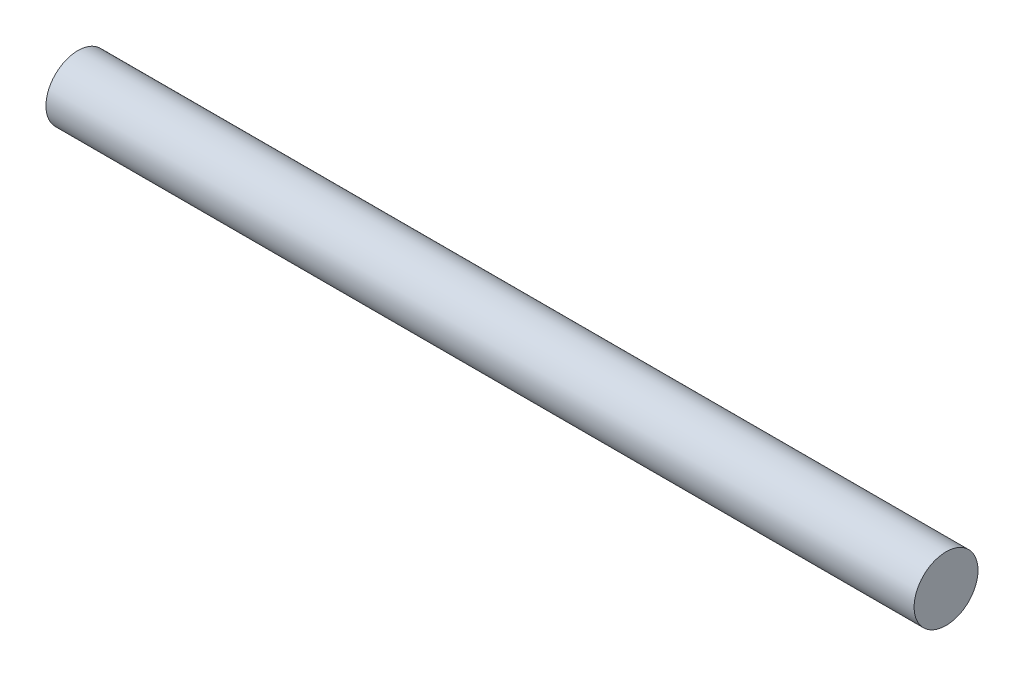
ISO-10303-21;
HEADER;
FILE_DESCRIPTION(('STEP AP214'),'2;1');
FILE_NAME('part.step','',(''),(''),'','','');
FILE_SCHEMA(('AUTOMOTIVE_DESIGN { 1 0 10303 214 1 1 1 1 }'));
ENDSEC;
DATA;
#1=APPLICATION_CONTEXT('core data for automotive mechanical design processes');
#2=APPLICATION_PROTOCOL_DEFINITION('international standard','automotive_design',2000,#1);
#3=PRODUCT_CONTEXT('',#1,'mechanical');
#4=PRODUCT('Part','Part','',(#3));
#5=PRODUCT_RELATED_PRODUCT_CATEGORY('part','',(#4));
#6=PRODUCT_DEFINITION_FORMATION('','',#4);
#7=PRODUCT_DEFINITION_CONTEXT('part definition',#1,'design');
#8=PRODUCT_DEFINITION('design','',#6,#7);
#9=PRODUCT_DEFINITION_SHAPE('','',#8);
#10=(LENGTH_UNIT() NAMED_UNIT(*) SI_UNIT(.MILLI.,.METRE.));
#11=(NAMED_UNIT(*) PLANE_ANGLE_UNIT() SI_UNIT($,.RADIAN.));
#12=(NAMED_UNIT(*) SI_UNIT($,.STERADIAN.) SOLID_ANGLE_UNIT());
#13=UNCERTAINTY_MEASURE_WITH_UNIT(LENGTH_MEASURE(1.E-05),#10,'distance_accuracy_value','');
#14=(GEOMETRIC_REPRESENTATION_CONTEXT(3) GLOBAL_UNCERTAINTY_ASSIGNED_CONTEXT((#13)) GLOBAL_UNIT_ASSIGNED_CONTEXT((#10,
#11,#12)) REPRESENTATION_CONTEXT('',''));
#15=CARTESIAN_POINT('',(0.,0.,0.));
#16=DIRECTION('',(0.,0.,1.));
#17=DIRECTION('',(1.,0.,0.));
#18=AXIS2_PLACEMENT_3D('',#15,#16,#17);
#19=CARTESIAN_POINT('',(-36.,0.,0.));
#20=DIRECTION('',(1.,0.,0.));
#21=DIRECTION('',(0.,0.,-1.));
#22=AXIS2_PLACEMENT_3D('',#19,#20,#21);
#23=PLANE('',#22);
#24=CARTESIAN_POINT('',(-36.,0.,0.));
#25=DIRECTION('',(1.,0.,0.));
#26=DIRECTION('',(0.,0.,-1.));
#27=AXIS2_PLACEMENT_3D('',#24,#25,#26);
#28=CIRCLE('',#27,2.65);
#29=CARTESIAN_POINT('',(-36.,0.,-2.65));
#30=VERTEX_POINT('',#29);
#31=EDGE_CURVE('E18',#30,#30,#28,.T.);
#32=ORIENTED_EDGE('',*,*,#31,.F.);
#33=EDGE_LOOP('',(#32));
#34=FACE_BOUND('',#33,.T.);
#35=ADVANCED_FACE('F14',(#34),#23,.F.);
#36=CARTESIAN_POINT('',(36.,0.,0.));
#37=DIRECTION('',(1.,0.,0.));
#38=DIRECTION('',(0.,0.,-1.));
#39=AXIS2_PLACEMENT_3D('',#36,#37,#38);
#40=PLANE('',#39);
#41=CARTESIAN_POINT('',(36.,0.,0.));
#42=DIRECTION('',(1.,0.,0.));
#43=DIRECTION('',(0.,0.,-1.));
#44=AXIS2_PLACEMENT_3D('',#41,#42,#43);
#45=CIRCLE('',#44,2.65);
#46=CARTESIAN_POINT('',(36.,0.,-2.65));
#47=VERTEX_POINT('',#46);
#48=EDGE_CURVE('E10',#47,#47,#45,.F.);
#49=ORIENTED_EDGE('',*,*,#48,.F.);
#50=EDGE_LOOP('',(#49));
#51=FACE_BOUND('',#50,.T.);
#52=ADVANCED_FACE('F29',(#51),#40,.T.);
#53=CARTESIAN_POINT('',(-36.,0.,0.));
#54=DIRECTION('',(1.,0.,0.));
#55=DIRECTION('',(0.,0.,-1.));
#56=AXIS2_PLACEMENT_3D('',#53,#54,#55);
#57=CYLINDRICAL_SURFACE('',#56,2.65);
#58=ORIENTED_EDGE('',*,*,#48,.T.);
#59=EDGE_LOOP('',(#58));
#60=FACE_BOUND('',#59,.T.);
#61=ORIENTED_EDGE('',*,*,#31,.T.);
#62=EDGE_LOOP('',(#61));
#63=FACE_BOUND('',#62,.T.);
#64=ADVANCED_FACE('F16',(#60,#63),#57,.T.);
#65=CLOSED_SHELL('',(#35,#52,#64));
#66=MANIFOLD_SOLID_BREP('B1',#65);
#67=ADVANCED_BREP_SHAPE_REPRESENTATION('',(#18,#66),#14);
#68=SHAPE_DEFINITION_REPRESENTATION(#9,#67);
ENDSEC;
END-ISO-10303-21;
